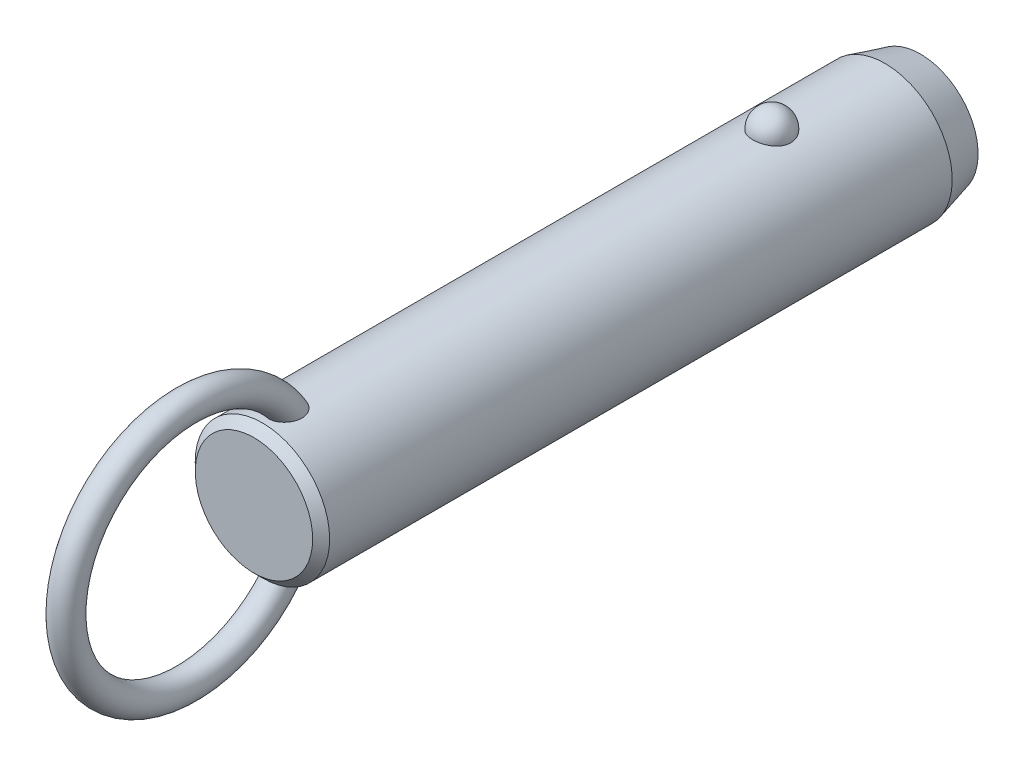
ISO-10303-21;
HEADER;
FILE_DESCRIPTION(('STEP AP214'),'2;1');
FILE_NAME('part.step','',(''),(''),'','','');
FILE_SCHEMA(('AUTOMOTIVE_DESIGN { 1 0 10303 214 1 1 1 1 }'));
ENDSEC;
DATA;
#1=APPLICATION_CONTEXT('core data for automotive mechanical design processes');
#2=APPLICATION_PROTOCOL_DEFINITION('international standard','automotive_design',2000,#1);
#3=PRODUCT_CONTEXT('',#1,'mechanical');
#4=PRODUCT('Part','Part','',(#3));
#5=PRODUCT_RELATED_PRODUCT_CATEGORY('part','',(#4));
#6=PRODUCT_DEFINITION_FORMATION('','',#4);
#7=PRODUCT_DEFINITION_CONTEXT('part definition',#1,'design');
#8=PRODUCT_DEFINITION('design','',#6,#7);
#9=PRODUCT_DEFINITION_SHAPE('','',#8);
#10=(LENGTH_UNIT() NAMED_UNIT(*) SI_UNIT(.MILLI.,.METRE.));
#11=(NAMED_UNIT(*) PLANE_ANGLE_UNIT() SI_UNIT($,.RADIAN.));
#12=(NAMED_UNIT(*) SI_UNIT($,.STERADIAN.) SOLID_ANGLE_UNIT());
#13=UNCERTAINTY_MEASURE_WITH_UNIT(LENGTH_MEASURE(1.E-05),#10,'distance_accuracy_value','');
#14=(GEOMETRIC_REPRESENTATION_CONTEXT(3) GLOBAL_UNCERTAINTY_ASSIGNED_CONTEXT((#13)) GLOBAL_UNIT_ASSIGNED_CONTEXT((#10,
#11,#12)) REPRESENTATION_CONTEXT('',''));
#15=CARTESIAN_POINT('',(0.,0.,0.));
#16=DIRECTION('',(0.,0.,1.));
#17=DIRECTION('',(1.,0.,0.));
#18=AXIS2_PLACEMENT_3D('',#15,#16,#17);
#19=CARTESIAN_POINT('',(0.,0.,61.));
#20=DIRECTION('',(0.,0.,-1.));
#21=DIRECTION('',(-1.,0.,0.));
#22=AXIS2_PLACEMENT_3D('',#19,#20,#21);
#23=CYLINDRICAL_SURFACE('',#22,9.5);
#24=CARTESIAN_POINT('',(2.67259918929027,9.11631578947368,-2.70000000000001));
#25=CARTESIAN_POINT('',(2.6725968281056,9.11631786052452,-2.54909854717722));
#26=CARTESIAN_POINT('',(2.66030567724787,9.11994722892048,-2.39816735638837));
#27=CARTESIAN_POINT('',(2.6114347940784,9.13405924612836,-2.10058568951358));
#28=CARTESIAN_POINT('',(2.57484658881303,9.14454428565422,-1.95393672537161));
#29=CARTESIAN_POINT('',(2.47830875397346,9.17117631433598,-1.66916069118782));
#30=CARTESIAN_POINT('',(2.41836936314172,9.18732082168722,-1.53102991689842));
#31=CARTESIAN_POINT('',(2.27661331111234,9.22346780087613,-1.26705393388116));
#32=CARTESIAN_POINT('',(2.19479699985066,9.24347021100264,-1.14120852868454));
#33=CARTESIAN_POINT('',(2.01085282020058,9.28522401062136,-0.904632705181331));
#34=CARTESIAN_POINT('',(1.90862396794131,9.30698376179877,-0.793982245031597));
#35=CARTESIAN_POINT('',(1.6867437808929,9.34973971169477,-0.591607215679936));
#36=CARTESIAN_POINT('',(1.56709244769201,9.37073591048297,-0.499882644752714));
#37=CARTESIAN_POINT('',(1.31393976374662,9.40956370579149,-0.338167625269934));
#38=CARTESIAN_POINT('',(1.18048026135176,9.42740444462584,-0.268113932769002));
#39=CARTESIAN_POINT('',(0.903154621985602,9.45799906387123,-0.151390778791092));
#40=CARTESIAN_POINT('',(0.759289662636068,9.47075351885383,-0.104718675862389));
#41=CARTESIAN_POINT('',(0.46807402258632,9.48956256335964,-0.0367633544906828));
#42=CARTESIAN_POINT('',(0.320836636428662,9.49573643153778,-0.0150275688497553));
#43=CARTESIAN_POINT('',(0.0246714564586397,9.50112183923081,0.0039619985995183));
#44=CARTESIAN_POINT('',(-0.124256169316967,9.50033406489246,0.00121819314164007));
#45=CARTESIAN_POINT('',(-0.417264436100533,9.4919475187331,-0.0284441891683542));
#46=CARTESIAN_POINT('',(-0.561384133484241,9.48444885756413,-0.0550074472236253));
#47=CARTESIAN_POINT('',(-0.842986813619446,9.46357853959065,-0.131064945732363));
#48=CARTESIAN_POINT('',(-0.98046968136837,9.450206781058,-0.180559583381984));
#49=CARTESIAN_POINT('',(-1.24585005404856,9.41890822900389,-0.301476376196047));
#50=CARTESIAN_POINT('',(-1.37368611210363,9.40095498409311,-0.373026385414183));
#51=CARTESIAN_POINT('',(-1.61552738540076,9.36242964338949,-0.536025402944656));
#52=CARTESIAN_POINT('',(-1.72953116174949,9.34185727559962,-0.627476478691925));
#53=CARTESIAN_POINT('',(-1.9429225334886,9.29984568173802,-0.829844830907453));
#54=CARTESIAN_POINT('',(-2.04198021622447,9.27839736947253,-0.94110821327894));
#55=CARTESIAN_POINT('',(-2.22026460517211,9.23735994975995,-1.17883414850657));
#56=CARTESIAN_POINT('',(-2.29948985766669,9.21777097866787,-1.30529781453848));
#57=CARTESIAN_POINT('',(-2.43697287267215,9.18238994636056,-1.57158566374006));
#58=CARTESIAN_POINT('',(-2.49497068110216,9.16664569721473,-1.71155057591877));
#59=CARTESIAN_POINT('',(-2.5872073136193,9.14104303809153,-1.99961197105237));
#60=CARTESIAN_POINT('',(-2.62144683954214,9.13118445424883,-2.14770821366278));
#61=CARTESIAN_POINT('',(-2.66521466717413,9.11850622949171,-2.44715424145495));
#62=CARTESIAN_POINT('',(-2.67484831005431,9.11565658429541,-2.59848735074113));
#63=CARTESIAN_POINT('',(-2.66946735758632,9.11723375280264,-2.90067317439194));
#64=CARTESIAN_POINT('',(-2.65445345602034,9.12166036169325,-3.05152590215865));
#65=CARTESIAN_POINT('',(-2.60029711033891,9.13724422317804,-3.34766110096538));
#66=CARTESIAN_POINT('',(-2.56127978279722,9.14836656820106,-3.49296833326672));
#67=CARTESIAN_POINT('',(-2.46018844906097,9.17606676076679,-3.77477535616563));
#68=CARTESIAN_POINT('',(-2.39811349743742,9.1926448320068,-3.9112747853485));
#69=CARTESIAN_POINT('',(-2.25202303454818,9.22952198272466,-4.17244273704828));
#70=CARTESIAN_POINT('',(-2.16788714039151,9.24984129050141,-4.29704106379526));
#71=CARTESIAN_POINT('',(-1.9799408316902,9.29188255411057,-4.53013066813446));
#72=CARTESIAN_POINT('',(-1.87612963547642,9.31360456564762,-4.63862130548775));
#73=CARTESIAN_POINT('',(-1.65105429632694,9.35612959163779,-4.8369029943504));
#74=CARTESIAN_POINT('',(-1.52972405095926,9.37692871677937,-4.92661991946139));
#75=CARTESIAN_POINT('',(-1.27318250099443,9.41518970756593,-5.08429106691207));
#76=CARTESIAN_POINT('',(-1.13797219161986,9.432651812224,-5.15224684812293));
#77=CARTESIAN_POINT('',(-0.859280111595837,9.46208255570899,-5.26371827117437));
#78=CARTESIAN_POINT('',(-0.715925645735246,9.47411833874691,-5.30753421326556));
#79=CARTESIAN_POINT('',(-0.423550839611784,9.4916822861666,-5.37076321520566));
#80=CARTESIAN_POINT('',(-0.274531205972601,9.49721125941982,-5.39017930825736));
#81=CARTESIAN_POINT('',(0.0218446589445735,9.50110860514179,-5.40390587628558));
#82=CARTESIAN_POINT('',(0.169177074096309,9.49961381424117,-5.39869609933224));
#83=CARTESIAN_POINT('',(0.460808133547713,9.48993906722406,-5.36441955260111));
#84=CARTESIAN_POINT('',(0.605106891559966,9.48175936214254,-5.33535367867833));
#85=CARTESIAN_POINT('',(0.886027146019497,9.4596376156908,-5.25435587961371));
#86=CARTESIAN_POINT('',(1.02267710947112,9.44571881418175,-5.20251612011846));
#87=CARTESIAN_POINT('',(1.28523827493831,9.41358993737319,-5.07741549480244));
#88=CARTESIAN_POINT('',(1.41114877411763,9.39537958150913,-5.00415322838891));
#89=CARTESIAN_POINT('',(1.65085227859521,9.3562644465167,-4.83684599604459));
#90=CARTESIAN_POINT('',(1.76442346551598,9.33532178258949,-4.74249218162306));
#91=CARTESIAN_POINT('',(1.97425672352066,9.29321198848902,-4.53620389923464));
#92=CARTESIAN_POINT('',(2.07051582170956,9.27204482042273,-4.42426641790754));
#93=CARTESIAN_POINT('',(2.24490086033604,9.23139221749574,-4.18363183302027));
#94=CARTESIAN_POINT('',(2.32267019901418,9.21194380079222,-4.05466990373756));
#95=CARTESIAN_POINT('',(2.45584092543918,9.1773419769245,-3.78517836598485));
#96=CARTESIAN_POINT('',(2.5112497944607,9.16218713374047,-3.64465264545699));
#97=CARTESIAN_POINT('',(2.59380876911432,9.13913522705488,-3.37104301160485));
#98=CARTESIAN_POINT('',(2.62330266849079,9.13064624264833,-3.23871053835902));
#99=CARTESIAN_POINT('',(2.66269870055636,9.11923566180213,-2.9709266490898));
#100=CARTESIAN_POINT('',(2.67260130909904,9.11631393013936,-2.83547530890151));
#101=CARTESIAN_POINT('',(2.67259918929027,9.11631578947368,-2.70000000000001));
#102=B_SPLINE_CURVE_WITH_KNOTS('',3,(#24,#25,#26,#27,#28,#29,#30,#31,#32,#33,#34,#35,#36,#37,
#38,#39,#40,#41,#42,#43,#44,#45,#46,#47,#48,#49,#50,#51,#52,#53,#54,#55,#56,#57,#58,#59,#60,#61,
#62,#63,#64,#65,#66,#67,#68,#69,#70,#71,#72,#73,#74,#75,#76,#77,#78,#79,#80,#81,#82,#83,#84,#85,
#86,#87,#88,#89,#90,#91,#92,#93,#94,#95,#96,#97,#98,#99,#100,#101),.UNSPECIFIED.,.T.,.F.,(4,2,2,
2,2,2,2,2,2,2,2,2,2,2,2,2,2,2,2,2,2,2,2,2,2,2,2,2,2,2,2,2,2,2,2,2,2,2,4),(0.,0.452217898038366,
0.904593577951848,1.35677112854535,1.80894144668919,2.26340676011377,2.71787203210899,
3.17099820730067,3.62407318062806,4.06878835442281,4.51345969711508,4.95160616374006,
5.38976021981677,5.83050358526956,6.27129275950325,6.72071308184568,7.17016633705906,
7.6249527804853,8.07972578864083,8.53254856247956,8.98535859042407,9.43582813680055,
9.88631615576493,10.3393155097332,10.7923328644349,11.2471065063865,11.7018475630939,
12.150795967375,12.599688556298,13.0398725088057,13.4800399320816,13.9184421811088,
14.3568730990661,14.802202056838,15.2476074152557,15.7010097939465,16.1542603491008,
16.5602594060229,16.9662486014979),.UNSPECIFIED.);
#103=CARTESIAN_POINT('',(2.67259918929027,9.11631578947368,-2.70000000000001));
#104=VERTEX_POINT('',#103);
#105=EDGE_CURVE('E41',#104,#104,#102,.T.);
#106=ORIENTED_EDGE('',*,*,#105,.T.);
#107=EDGE_LOOP('',(#106));
#108=FACE_BOUND('',#107,.T.);
#109=CARTESIAN_POINT('',(0.,0.,69.3200000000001));
#110=DIRECTION('',(0.,0.,1.));
#111=DIRECTION('',(1.,0.,0.));
#112=AXIS2_PLACEMENT_3D('',#109,#110,#111);
#113=CIRCLE('',#112,9.5);
#114=CARTESIAN_POINT('',(9.5,0.,69.3200000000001));
#115=VERTEX_POINT('',#114);
#116=EDGE_CURVE('E10',#115,#115,#113,.F.);
#117=ORIENTED_EDGE('',*,*,#116,.T.);
#118=EDGE_LOOP('',(#117));
#119=FACE_BOUND('',#118,.T.);
#120=CARTESIAN_POINT('',(-0.697062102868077,-9.47439269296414,63.6678088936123));
#121=CARTESIAN_POINT('',(-0.799579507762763,-9.46685146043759,63.7074823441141));
#122=CARTESIAN_POINT('',(-0.898575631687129,-9.45788043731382,63.7559309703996));
#123=CARTESIAN_POINT('',(-1.08670047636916,-9.43811593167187,63.8688685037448));
#124=CARTESIAN_POINT('',(-1.17583204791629,-9.42732297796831,63.9333527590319));
#125=CARTESIAN_POINT('',(-1.34179806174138,-9.40513672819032,64.0762099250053));
#126=CARTESIAN_POINT('',(-1.41865133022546,-9.39374438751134,64.154561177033));
#127=CARTESIAN_POINT('',(-1.5586004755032,-9.37154196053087,64.3227524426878));
#128=CARTESIAN_POINT('',(-1.62169476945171,-9.3607319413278,64.4125937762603));
#129=CARTESIAN_POINT('',(-1.73527695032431,-9.34035749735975,64.6045001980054));
#130=CARTESIAN_POINT('',(-1.7852226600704,-9.33085270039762,64.7068910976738));
#131=CARTESIAN_POINT('',(-1.86924997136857,-9.3143834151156,64.918148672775));
#132=CARTESIAN_POINT('',(-1.90332570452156,-9.30741986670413,65.0270177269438));
#133=CARTESIAN_POINT('',(-1.95893603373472,-9.29588482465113,65.2604730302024));
#134=CARTESIAN_POINT('',(-1.97872420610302,-9.29165182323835,65.3854890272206));
#135=CARTESIAN_POINT('',(-2.00062129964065,-9.28695978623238,65.6370805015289));
#136=CARTESIAN_POINT('',(-2.00272284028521,-9.28650232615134,65.763656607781));
#137=CARTESIAN_POINT('',(-1.98958876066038,-9.28932750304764,66.0368157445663));
#138=CARTESIAN_POINT('',(-1.97143366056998,-9.2932400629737,66.1832519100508));
#139=CARTESIAN_POINT('',(-1.91479925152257,-9.30507151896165,66.4720629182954));
#140=CARTESIAN_POINT('',(-1.87629122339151,-9.31299607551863,66.614431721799));
#141=CARTESIAN_POINT('',(-1.77225683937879,-9.33340232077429,66.9151725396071));
#142=CARTESIAN_POINT('',(-1.70334898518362,-9.34641636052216,67.0723691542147));
#143=CARTESIAN_POINT('',(-1.58111062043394,-9.36759153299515,67.2975171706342));
#144=CARTESIAN_POINT('',(-1.53721459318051,-9.37492619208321,67.3707968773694));
#145=CARTESIAN_POINT('',(-1.4430263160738,-9.38988566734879,67.5130740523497));
#146=CARTESIAN_POINT('',(-1.39273721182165,-9.39751033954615,67.5820736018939));
#147=CARTESIAN_POINT('',(-1.26775962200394,-9.41530678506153,67.7369832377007));
#148=CARTESIAN_POINT('',(-1.19052326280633,-9.42548108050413,67.8208712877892));
#149=CARTESIAN_POINT('',(-1.02420241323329,-9.44499825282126,67.9760086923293));
#150=CARTESIAN_POINT('',(-0.935139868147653,-9.45434261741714,68.0472808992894));
#151=CARTESIAN_POINT('',(-0.766610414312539,-9.46930670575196,68.1586955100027));
#152=CARTESIAN_POINT('',(-0.689439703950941,-9.47529223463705,68.2022354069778));
#153=CARTESIAN_POINT('',(-0.52894200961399,-9.48560294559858,68.2763133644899));
#154=CARTESIAN_POINT('',(-0.445620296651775,-9.48992953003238,68.3068624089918));
#155=CARTESIAN_POINT('',(-0.273901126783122,-9.49644161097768,68.3525792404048));
#156=CARTESIAN_POINT('',(-0.185465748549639,-9.49860811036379,68.36761059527));
#157=CARTESIAN_POINT('',(-0.0073454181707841,-9.5004135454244,68.3801494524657));
#158=CARTESIAN_POINT('',(0.0823387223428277,-9.50005405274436,68.3776678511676));
#159=CARTESIAN_POINT('',(0.247679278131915,-9.49708301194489,68.3569959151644));
#160=CARTESIAN_POINT('',(0.323620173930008,-9.49477609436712,68.3409300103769));
#161=CARTESIAN_POINT('',(0.471981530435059,-9.48855917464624,68.2971726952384));
#162=CARTESIAN_POINT('',(0.544400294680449,-9.48464840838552,68.2694757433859));
#163=CARTESIAN_POINT('',(0.708947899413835,-9.47398336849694,68.1928026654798));
#164=CARTESIAN_POINT('',(0.799149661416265,-9.46671310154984,68.1397745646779));
#165=CARTESIAN_POINT('',(0.96978399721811,-9.45076225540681,68.0199731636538));
#166=CARTESIAN_POINT('',(1.05019415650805,-9.44207854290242,67.9531692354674));
#167=CARTESIAN_POINT('',(1.23092343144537,-9.42051459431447,67.7807596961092));
#168=CARTESIAN_POINT('',(1.32652499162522,-9.40733378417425,67.6702619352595));
#169=CARTESIAN_POINT('',(1.49893121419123,-9.38140745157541,67.4355614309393));
#170=CARTESIAN_POINT('',(1.57571616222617,-9.36866239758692,67.3113445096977));
#171=CARTESIAN_POINT('',(1.71285426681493,-9.34457644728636,67.0493891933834));
#172=CARTESIAN_POINT('',(1.77266365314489,-9.33328726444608,66.9113623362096));
#173=CARTESIAN_POINT('',(1.87239208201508,-9.31379209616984,66.6280515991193));
#174=CARTESIAN_POINT('',(1.91230158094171,-9.3055875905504,66.482764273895));
#175=CARTESIAN_POINT('',(1.9760418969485,-9.29228394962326,66.1620281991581));
#176=CARTESIAN_POINT('',(1.99587438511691,-9.28797202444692,65.9857248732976));
#177=CARTESIAN_POINT('',(2.0029570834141,-9.28645519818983,65.6324146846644));
#178=CARTESIAN_POINT('',(1.99025930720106,-9.28923895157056,65.4554093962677));
#179=CARTESIAN_POINT('',(1.93735479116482,-9.30038134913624,65.1563381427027));
#180=CARTESIAN_POINT('',(1.90576827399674,-9.30697680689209,65.0326679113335));
#181=CARTESIAN_POINT('',(1.82287484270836,-9.32356855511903,64.7923297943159));
#182=CARTESIAN_POINT('',(1.7715821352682,-9.33356239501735,64.6756569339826));
#183=CARTESIAN_POINT('',(1.64885744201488,-9.35602275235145,64.4527061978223));
#184=CARTESIAN_POINT('',(1.57730995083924,-9.36850332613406,64.3464927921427));
#185=CARTESIAN_POINT('',(1.41543264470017,-9.39431873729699,64.1495530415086));
#186=CARTESIAN_POINT('',(1.32510883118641,-9.40765330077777,64.0588217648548));
#187=CARTESIAN_POINT('',(1.13846223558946,-9.43195720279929,63.9050334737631));
#188=CARTESIAN_POINT('',(1.04369890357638,-9.44302894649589,63.8400947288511));
#189=CARTESIAN_POINT('',(0.843965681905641,-9.46296805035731,63.7280388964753));
#190=CARTESIAN_POINT('',(0.739000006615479,-9.4718363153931,63.6809144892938));
#191=CARTESIAN_POINT('',(0.528175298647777,-9.48586140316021,63.6081173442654));
#192=CARTESIAN_POINT('',(0.422686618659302,-9.49119633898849,63.5814024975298));
#193=CARTESIAN_POINT('',(0.208590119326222,-9.49831365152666,63.5460137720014));
#194=CARTESIAN_POINT('',(0.0999817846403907,-9.500095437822,63.5373428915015));
#195=CARTESIAN_POINT('',(-0.126104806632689,-9.49988861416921,63.5383501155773));
#196=CARTESIAN_POINT('',(-0.243578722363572,-9.49757821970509,63.5495942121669));
#197=CARTESIAN_POINT('',(-0.474390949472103,-9.48885165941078,63.593167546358));
#198=CARTESIAN_POINT('',(-0.587729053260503,-9.48243528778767,63.6254978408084));
#199=CARTESIAN_POINT('',(-0.697062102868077,-9.47439269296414,63.6678088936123));
#200=B_SPLINE_CURVE_WITH_KNOTS('',3,(#120,#121,#122,#123,#124,#125,#126,#127,#128,#129,#130,
#131,#132,#133,#134,#135,#136,#137,#138,#139,#140,#141,#142,#143,#144,#145,#146,#147,#148,#149,
#150,#151,#152,#153,#154,#155,#156,#157,#158,#159,#160,#161,#162,#163,#164,#165,#166,#167,#168,
#169,#170,#171,#172,#173,#174,#175,#176,#177,#178,#179,#180,#181,#182,#183,#184,#185,#186,#187,
#188,#189,#190,#191,#192,#193,#194,#195,#196,#197,#198,#199),.UNSPECIFIED.,.T.,.F.,(4,2,2,2,2,2,
2,2,2,2,2,2,2,2,2,2,2,2,2,2,2,2,2,2,2,2,2,2,2,2,2,2,2,2,2,2,2,2,2,4),(0.,0.330119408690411,
0.660143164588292,0.989655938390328,1.31920659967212,1.66074728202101,2.00241415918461,
2.38088696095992,2.75951768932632,3.20065679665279,3.6424200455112,4.15620996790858,
4.4131416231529,4.66994734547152,5.01228664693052,5.35399933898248,5.61943037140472,
5.88463652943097,6.15215502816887,6.41950709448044,6.6514439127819,6.88349136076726,
7.19641200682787,7.51003602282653,7.94779711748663,8.38601491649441,8.83699707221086,
9.28819530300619,9.81778662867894,10.3465317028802,10.7284172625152,11.110028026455,
11.4938603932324,11.8775702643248,12.2220189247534,12.5663259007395,12.8915939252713,
13.2169159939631,13.5689650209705,13.9210316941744),.UNSPECIFIED.);
#201=CARTESIAN_POINT('',(-0.697062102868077,-9.47439269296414,63.6678088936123));
#202=VERTEX_POINT('',#201);
#203=EDGE_CURVE('E60',#202,#202,#200,.T.);
#204=ORIENTED_EDGE('',*,*,#203,.T.);
#205=EDGE_LOOP('',(#204));
#206=FACE_BOUND('',#205,.T.);
#207=CARTESIAN_POINT('',(-0.697062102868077,9.47439269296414,63.6678088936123));
#208=CARTESIAN_POINT('',(-0.597792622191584,9.48169483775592,63.6293956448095));
#209=CARTESIAN_POINT('',(-0.495106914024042,9.48766580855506,63.5991682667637));
#210=CARTESIAN_POINT('',(-0.285876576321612,9.49627648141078,63.5560327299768));
#211=CARTESIAN_POINT('',(-0.179324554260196,9.49890941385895,63.5431597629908));
#212=CARTESIAN_POINT('',(0.0344157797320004,9.50053798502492,63.5351666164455));
#213=CARTESIAN_POINT('',(0.141603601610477,9.49953613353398,63.5400341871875));
#214=CARTESIAN_POINT('',(0.353563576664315,9.49401038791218,63.5673654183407));
#215=CARTESIAN_POINT('',(0.458336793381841,9.48948807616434,63.58982117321));
#216=CARTESIAN_POINT('',(0.662493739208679,9.4774236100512,63.6516719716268));
#217=CARTESIAN_POINT('',(0.761881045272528,9.46988348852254,63.6910556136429));
#218=CARTESIAN_POINT('',(0.952608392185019,9.45260382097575,63.7856342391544));
#219=CARTESIAN_POINT('',(1.04394806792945,9.44286417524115,63.8408299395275));
#220=CARTESIAN_POINT('',(1.21712767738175,9.4221176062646,63.9660662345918));
#221=CARTESIAN_POINT('',(1.29885671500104,9.41109835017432,64.0362579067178));
#222=CARTESIAN_POINT('',(1.4497897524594,9.38903310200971,64.188980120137));
#223=CARTESIAN_POINT('',(1.51899278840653,9.37798710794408,64.2715116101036));
#224=CARTESIAN_POINT('',(1.64602857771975,9.35654375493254,64.4497763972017));
#225=CARTESIAN_POINT('',(1.70333052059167,9.34618688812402,64.5458916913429));
#226=CARTESIAN_POINT('',(1.80259341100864,9.32755128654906,64.745897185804));
#227=CARTESIAN_POINT('',(1.84454942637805,9.31927322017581,64.8497898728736));
#228=CARTESIAN_POINT('',(1.91637039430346,9.30478365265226,65.0722131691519));
#229=CARTESIAN_POINT('',(1.944805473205,9.29882552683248,65.1912192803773));
#230=CARTESIAN_POINT('',(1.98449865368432,9.29043398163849,65.4321436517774));
#231=CARTESIAN_POINT('',(1.99574908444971,9.28800213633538,65.5540631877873));
#232=CARTESIAN_POINT('',(2.00275141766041,9.28649645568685,65.8169324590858));
#233=CARTESIAN_POINT('',(1.99588238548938,9.28799035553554,65.9579529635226));
#234=CARTESIAN_POINT('',(1.96270559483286,9.29505517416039,66.2376217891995));
#235=CARTESIAN_POINT('',(1.93637872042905,9.30063010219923,66.376267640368));
#236=CARTESIAN_POINT('',(1.85949176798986,9.31633564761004,66.6725616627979));
#237=CARTESIAN_POINT('',(1.80549792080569,9.3270926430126,66.8292907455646));
#238=CARTESIAN_POINT('',(1.67376869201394,9.35163064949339,67.1322840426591));
#239=CARTESIAN_POINT('',(1.59603181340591,9.36541185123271,67.2785475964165));
#240=CARTESIAN_POINT('',(1.43602774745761,9.39110706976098,67.5258138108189));
#241=CARTESIAN_POINT('',(1.35831795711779,9.40278656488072,67.629791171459));
#242=CARTESIAN_POINT('',(1.18774483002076,9.42585025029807,67.8245347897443));
#243=CARTESIAN_POINT('',(1.09490932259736,9.43723493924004,67.9153247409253));
#244=CARTESIAN_POINT('',(0.921110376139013,9.45552616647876,68.0562033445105));
#245=CARTESIAN_POINT('',(0.84373824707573,9.46281058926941,68.1106563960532));
#246=CARTESIAN_POINT('',(0.681245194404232,9.47589120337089,68.2067117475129));
#247=CARTESIAN_POINT('',(0.59613566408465,9.48168953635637,68.2483325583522));
#248=CARTESIAN_POINT('',(0.433779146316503,9.49038144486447,68.3100899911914));
#249=CARTESIAN_POINT('',(0.357459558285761,9.49359170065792,68.3326013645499));
#250=CARTESIAN_POINT('',(0.202074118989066,9.49816761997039,68.3645745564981));
#251=CARTESIAN_POINT('',(0.123010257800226,9.49953459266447,68.3740456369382));
#252=CARTESIAN_POINT('',(-0.0357372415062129,9.50026497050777,68.3791143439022));
#253=CARTESIAN_POINT('',(-0.115421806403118,9.49962433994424,68.3746840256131));
#254=CARTESIAN_POINT('',(-0.272823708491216,9.49640854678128,68.3522962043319));
#255=CARTESIAN_POINT('',(-0.350540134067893,9.4938325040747,68.3343325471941));
#256=CARTESIAN_POINT('',(-0.50058091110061,9.48709462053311,68.2868028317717));
#257=CARTESIAN_POINT('',(-0.572979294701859,9.48296359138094,68.2574618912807));
#258=CARTESIAN_POINT('',(-0.712864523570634,9.47347609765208,68.1890087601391));
#259=CARTESIAN_POINT('',(-0.780349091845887,9.46811906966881,68.1498920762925));
#260=CARTESIAN_POINT('',(-0.946309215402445,9.45329720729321,68.039432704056));
#261=CARTESIAN_POINT('',(-1.04090230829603,9.44321512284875,67.9623297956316));
#262=CARTESIAN_POINT('',(-1.21661929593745,9.42219227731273,67.7940971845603));
#263=CARTESIAN_POINT('',(-1.2977051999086,9.41124921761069,67.7029292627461));
#264=CARTESIAN_POINT('',(-1.47319646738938,9.38563439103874,67.4761621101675));
#265=CARTESIAN_POINT('',(-1.56208878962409,9.37102009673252,67.3362895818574));
#266=CARTESIAN_POINT('',(-1.71623987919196,9.34401559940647,67.0439503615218));
#267=CARTESIAN_POINT('',(-1.78147866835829,9.33162728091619,66.891473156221));
#268=CARTESIAN_POINT('',(-1.88853837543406,9.31055541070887,66.5756470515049));
#269=CARTESIAN_POINT('',(-1.92998995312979,9.30193076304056,66.4121685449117));
#270=CARTESIAN_POINT('',(-1.98590726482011,9.29015757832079,66.0805268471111));
#271=CARTESIAN_POINT('',(-2.0004070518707,9.2870021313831,65.9123698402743));
#272=CARTESIAN_POINT('',(-1.99964701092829,9.28716218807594,65.6050806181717));
#273=CARTESIAN_POINT('',(-1.98908145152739,9.28945704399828,65.4659362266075));
#274=CARTESIAN_POINT('',(-1.94566294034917,9.29865169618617,65.1911539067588));
#275=CARTESIAN_POINT('',(-1.91282062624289,9.30554929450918,65.055514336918));
#276=CARTESIAN_POINT('',(-1.84582133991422,9.31898248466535,64.8578026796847));
#277=CARTESIAN_POINT('',(-1.82038084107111,9.32400364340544,64.792583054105));
#278=CARTESIAN_POINT('',(-1.7635051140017,9.33492884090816,64.6649033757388));
#279=CARTESIAN_POINT('',(-1.73207305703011,9.3408324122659,64.6024418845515));
#280=CARTESIAN_POINT('',(-1.66324243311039,9.353333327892,64.4809407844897));
#281=CARTESIAN_POINT('',(-1.62584239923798,9.35993084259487,64.4219020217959));
#282=CARTESIAN_POINT('',(-1.54527678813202,9.37356864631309,64.3079875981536));
#283=CARTESIAN_POINT('',(-1.50211241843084,9.38060884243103,64.2531110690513));
#284=CARTESIAN_POINT('',(-1.37681147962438,9.40004442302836,64.1099619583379));
#285=CARTESIAN_POINT('',(-1.28916358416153,9.41261047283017,64.0264295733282));
#286=CARTESIAN_POINT('',(-1.09996826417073,9.43658180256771,63.8772360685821));
#287=CARTESIAN_POINT('',(-0.998461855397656,9.44799034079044,63.8115238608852));
#288=CARTESIAN_POINT('',(-0.860188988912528,9.46103017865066,63.7394367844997));
#289=CARTESIAN_POINT('',(-0.828141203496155,9.46389141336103,63.7238511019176));
#290=CARTESIAN_POINT('',(-0.763210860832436,9.46934915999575,63.6944734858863));
#291=CARTESIAN_POINT('',(-0.730328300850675,9.47194567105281,63.6806815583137));
#292=CARTESIAN_POINT('',(-0.697062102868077,9.47439269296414,63.6678088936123));
#293=B_SPLINE_CURVE_WITH_KNOTS('',3,(#207,#208,#209,#210,#211,#212,#213,#214,#215,#216,#217,
#218,#219,#220,#221,#222,#223,#224,#225,#226,#227,#228,#229,#230,#231,#232,#233,#234,#235,#236,
#237,#238,#239,#240,#241,#242,#243,#244,#245,#246,#247,#248,#249,#250,#251,#252,#253,#254,#255,
#256,#257,#258,#259,#260,#261,#262,#263,#264,#265,#266,#267,#268,#269,#270,#271,#272,#273,#274,
#275,#276,#277,#278,#279,#280,#281,#282,#283,#284,#285,#286,#287,#288,#289,#290,#291,#292),
.UNSPECIFIED.,.T.,.F.,(4,2,2,2,2,2,2,2,2,2,2,2,2,2,2,2,2,2,2,2,2,2,2,2,2,2,2,2,2,2,2,2,2,2,2,2,
2,2,2,2,2,2,4),(0.,0.319942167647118,0.640532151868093,0.96090081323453,1.28112555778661,
1.60113495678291,1.92115886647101,2.24457323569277,2.56801248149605,2.90371927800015,
3.23953387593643,3.6056031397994,3.97183576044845,4.39383693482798,4.81625324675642,
5.31257045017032,5.80891895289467,6.19868344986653,6.58773876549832,6.87145417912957,
7.15475838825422,7.39263751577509,7.63034760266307,7.86853584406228,8.10683246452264,
8.34063661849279,8.57454843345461,8.93983939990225,9.30614105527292,9.8026666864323,
10.2996107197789,10.8040753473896,11.3079021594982,11.7249776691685,12.1418541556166,
12.3521485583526,12.562331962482,12.7725671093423,12.9827582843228,13.3458276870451,
13.7078449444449,13.8150604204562,13.9222762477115),.UNSPECIFIED.);
#294=CARTESIAN_POINT('',(-0.697062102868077,9.47439269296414,63.6678088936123));
#295=VERTEX_POINT('',#294);
#296=EDGE_CURVE('E67',#295,#295,#293,.T.);
#297=ORIENTED_EDGE('',*,*,#296,.T.);
#298=EDGE_LOOP('',(#297));
#299=FACE_BOUND('',#298,.T.);
#300=CARTESIAN_POINT('',(0.,0.,-18.7));
#301=DIRECTION('',(0.,0.,-1.));
#302=DIRECTION('',(-1.,0.,0.));
#303=AXIS2_PLACEMENT_3D('',#300,#301,#302);
#304=CIRCLE('',#303,9.5);
#305=CARTESIAN_POINT('',(-9.5,0.,-18.7));
#306=VERTEX_POINT('',#305);
#307=EDGE_CURVE('E57',#306,#306,#304,.F.);
#308=ORIENTED_EDGE('',*,*,#307,.T.);
#309=EDGE_LOOP('',(#308));
#310=FACE_BOUND('',#309,.T.);
#311=ADVANCED_FACE('F37',(#108,#119,#206,#299,#310),#23,.T.);
#312=CARTESIAN_POINT('',(0.,0.,-23.7));
#313=DIRECTION('',(0.,0.,-1.));
#314=DIRECTION('',(-1.,0.,0.));
#315=AXIS2_PLACEMENT_3D('',#312,#313,#314);
#316=PLANE('',#315);
#317=CARTESIAN_POINT('',(0.,0.,-23.7));
#318=DIRECTION('',(0.,0.,-1.));
#319=DIRECTION('',(-1.,0.,0.));
#320=AXIS2_PLACEMENT_3D('',#317,#318,#319);
#321=CIRCLE('',#320,8.1602540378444);
#322=CARTESIAN_POINT('',(-8.1602540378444,0.,-23.7));
#323=VERTEX_POINT('',#322);
#324=EDGE_CURVE('E66',#323,#323,#321,.T.);
#325=ORIENTED_EDGE('',*,*,#324,.T.);
#326=EDGE_LOOP('',(#325));
#327=FACE_BOUND('',#326,.T.);
#328=ADVANCED_FACE('F85',(#327),#316,.T.);
#329=CARTESIAN_POINT('',(0.,0.,-23.7));
#330=DIRECTION('',(0.,0.,1.));
#331=DIRECTION('',(1.,0.,0.));
#332=AXIS2_PLACEMENT_3D('',#329,#330,#331);
#333=CONICAL_SURFACE('',#332,8.1602540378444,0.261799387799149);
#334=ORIENTED_EDGE('',*,*,#307,.F.);
#335=EDGE_LOOP('',(#334));
#336=FACE_BOUND('',#335,.T.);
#337=ORIENTED_EDGE('',*,*,#324,.F.);
#338=EDGE_LOOP('',(#337));
#339=FACE_BOUND('',#338,.T.);
#340=ADVANCED_FACE('F83',(#336,#339),#333,.T.);
#341=CARTESIAN_POINT('',(0.,0.,70.52));
#342=DIRECTION('',(0.,0.,1.));
#343=DIRECTION('',(1.,0.,0.));
#344=AXIS2_PLACEMENT_3D('',#341,#342,#343);
#345=PLANE('',#344);
#346=CARTESIAN_POINT('',(0.,0.,70.52));
#347=DIRECTION('',(0.,0.,1.));
#348=DIRECTION('',(1.,0.,0.));
#349=AXIS2_PLACEMENT_3D('',#346,#347,#348);
#350=CIRCLE('',#349,8.30000000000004);
#351=CARTESIAN_POINT('',(8.30000000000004,0.,70.52));
#352=VERTEX_POINT('',#351);
#353=EDGE_CURVE('E50',#352,#352,#350,.T.);
#354=ORIENTED_EDGE('',*,*,#353,.T.);
#355=EDGE_LOOP('',(#354));
#356=FACE_BOUND('',#355,.T.);
#357=ADVANCED_FACE('F77',(#356),#345,.T.);
#358=CARTESIAN_POINT('',(0.,0.,80.05));
#359=DIRECTION('',(1.,0.,0.));
#360=DIRECTION('',(0.,0.,-1.));
#361=AXIS2_PLACEMENT_3D('',#358,#359,#360);
#362=TOROIDAL_SURFACE('',#361,17.05,2.);
#363=ORIENTED_EDGE('',*,*,#296,.F.);
#364=EDGE_LOOP('',(#363));
#365=FACE_BOUND('',#364,.T.);
#366=ORIENTED_EDGE('',*,*,#203,.F.);
#367=EDGE_LOOP('',(#366));
#368=FACE_BOUND('',#367,.T.);
#369=ADVANCED_FACE('F73',(#365,#368),#362,.T.);
#370=CARTESIAN_POINT('',(0.,0.,70.52));
#371=DIRECTION('',(0.,0.,-1.));
#372=DIRECTION('',(-1.,0.,0.));
#373=AXIS2_PLACEMENT_3D('',#370,#371,#372);
#374=CONICAL_SURFACE('',#373,8.30000000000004,0.785398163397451);
#375=ORIENTED_EDGE('',*,*,#116,.F.);
#376=EDGE_LOOP('',(#375));
#377=FACE_BOUND('',#376,.T.);
#378=ORIENTED_EDGE('',*,*,#353,.F.);
#379=EDGE_LOOP('',(#378));
#380=FACE_BOUND('',#379,.T.);
#381=ADVANCED_FACE('F39',(#377,#380),#374,.T.);
#382=CARTESIAN_POINT('',(0.,9.5,-2.70000000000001));
#383=DIRECTION('',(0.,1.,0.));
#384=DIRECTION('',(0.,0.,-1.));
#385=AXIS2_PLACEMENT_3D('',#382,#383,#384);
#386=SPHERICAL_SURFACE('',#385,2.7);
#387=ORIENTED_EDGE('',*,*,#105,.F.);
#388=EDGE_LOOP('',(#387));
#389=FACE_BOUND('',#388,.T.);
#390=ADVANCED_FACE('F79',(#389),#386,.T.);
#391=CLOSED_SHELL('',(#311,#328,#340,#357,#369,#381,#390));
#392=MANIFOLD_SOLID_BREP('B2',#391);
#393=ADVANCED_BREP_SHAPE_REPRESENTATION('',(#18,#392),#14);
#394=SHAPE_DEFINITION_REPRESENTATION(#9,#393);
ENDSEC;
END-ISO-10303-21;
